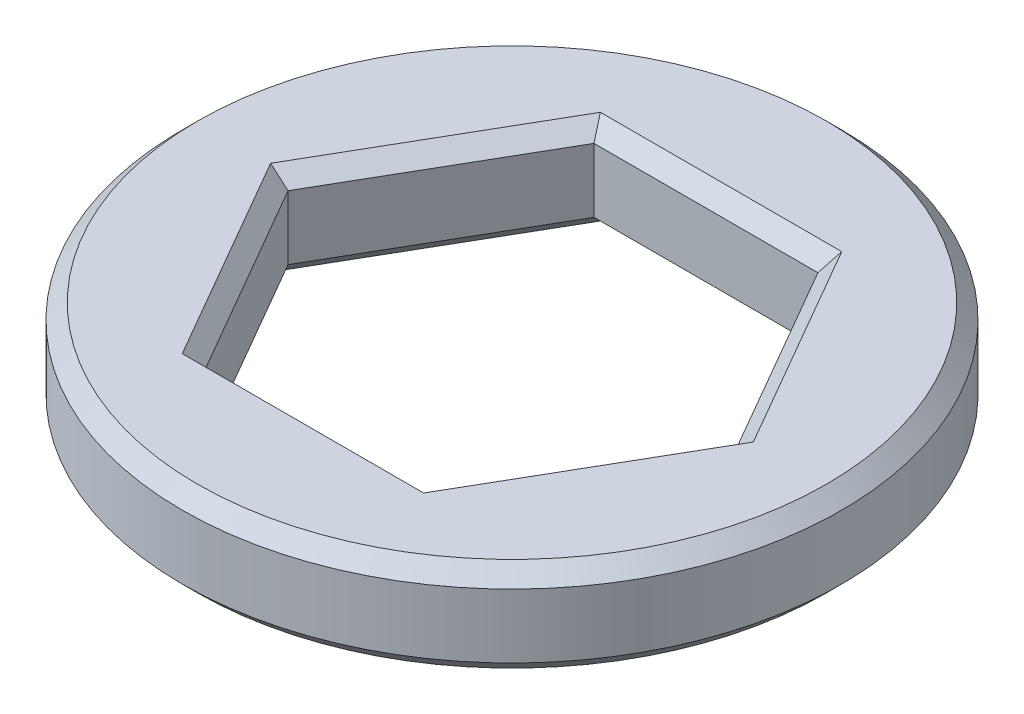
ISO-10303-21;
HEADER;
FILE_DESCRIPTION(('STEP AP214'),'2;1');
FILE_NAME('part.step','',(''),(''),'','','');
FILE_SCHEMA(('AUTOMOTIVE_DESIGN { 1 0 10303 214 1 1 1 1 }'));
ENDSEC;
DATA;
#1=APPLICATION_CONTEXT('core data for automotive mechanical design processes');
#2=APPLICATION_PROTOCOL_DEFINITION('international standard','automotive_design',2000,#1);
#3=PRODUCT_CONTEXT('',#1,'mechanical');
#4=PRODUCT('Part','Part','',(#3));
#5=PRODUCT_RELATED_PRODUCT_CATEGORY('part','',(#4));
#6=PRODUCT_DEFINITION_FORMATION('','',#4);
#7=PRODUCT_DEFINITION_CONTEXT('part definition',#1,'design');
#8=PRODUCT_DEFINITION('design','',#6,#7);
#9=PRODUCT_DEFINITION_SHAPE('','',#8);
#10=(LENGTH_UNIT() NAMED_UNIT(*) SI_UNIT(.MILLI.,.METRE.));
#11=(NAMED_UNIT(*) PLANE_ANGLE_UNIT() SI_UNIT($,.RADIAN.));
#12=(NAMED_UNIT(*) SI_UNIT($,.STERADIAN.) SOLID_ANGLE_UNIT());
#13=UNCERTAINTY_MEASURE_WITH_UNIT(LENGTH_MEASURE(1.E-05),#10,'distance_accuracy_value','');
#14=(GEOMETRIC_REPRESENTATION_CONTEXT(3) GLOBAL_UNCERTAINTY_ASSIGNED_CONTEXT((#13)) GLOBAL_UNIT_ASSIGNED_CONTEXT((#10,
#11,#12)) REPRESENTATION_CONTEXT('',''));
#15=CARTESIAN_POINT('',(0.,0.,0.));
#16=DIRECTION('',(0.,0.,1.));
#17=DIRECTION('',(1.,0.,0.));
#18=AXIS2_PLACEMENT_3D('',#15,#16,#17);
#19=CARTESIAN_POINT('',(0.,3.175,0.));
#20=DIRECTION('',(0.,1.,0.));
#21=DIRECTION('',(0.,0.,1.));
#22=AXIS2_PLACEMENT_3D('',#19,#20,#21);
#23=PLANE('',#22);
#24=CARTESIAN_POINT('',(0.,3.175,0.));
#25=DIRECTION('',(0.,1.,0.));
#26=DIRECTION('',(0.,0.,1.));
#27=AXIS2_PLACEMENT_3D('',#24,#25,#26);
#28=CIRCLE('',#27,10.6045);
#29=CARTESIAN_POINT('',(0.,3.175,10.6045));
#30=VERTEX_POINT('',#29);
#31=EDGE_CURVE('E13',#30,#30,#28,.T.);
#32=ORIENTED_EDGE('',*,*,#31,.T.);
#33=EDGE_LOOP('',(#32));
#34=FACE_BOUND('',#33,.T.);
#35=DIRECTION('',(-1.,0.,0.));
#36=VECTOR('',#35,1.);
#37=CARTESIAN_POINT('',(0.,3.175,7.0485));
#38=LINE('',#37,#36);
#39=CARTESIAN_POINT('',(4.06945337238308,3.175,7.0485));
#40=VERTEX_POINT('',#39);
#41=CARTESIAN_POINT('',(-4.06945337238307,3.175,7.04850000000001));
#42=VERTEX_POINT('',#41);
#43=EDGE_CURVE('E70',#40,#42,#38,.T.);
#44=ORIENTED_EDGE('',*,*,#43,.T.);
#45=DIRECTION('',(-0.5,0.,-0.866025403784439));
#46=VECTOR('',#45,1.);
#47=CARTESIAN_POINT('',(-6.10418005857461,3.175,3.52425));
#48=LINE('',#47,#46);
#49=CARTESIAN_POINT('',(-8.13890674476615,3.175,0.));
#50=VERTEX_POINT('',#49);
#51=EDGE_CURVE('E62',#42,#50,#48,.T.);
#52=ORIENTED_EDGE('',*,*,#51,.T.);
#53=DIRECTION('',(0.499999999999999,0.,-0.866025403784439));
#54=VECTOR('',#53,1.);
#55=CARTESIAN_POINT('',(-6.10418005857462,3.175,-3.52425));
#56=LINE('',#55,#54);
#57=CARTESIAN_POINT('',(-4.06945337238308,3.175,-7.0485));
#58=VERTEX_POINT('',#57);
#59=EDGE_CURVE('E225',#50,#58,#56,.T.);
#60=ORIENTED_EDGE('',*,*,#59,.T.);
#61=DIRECTION('',(1.,0.,0.));
#62=VECTOR('',#61,1.);
#63=CARTESIAN_POINT('',(0.,3.175,-7.0485));
#64=LINE('',#63,#62);
#65=CARTESIAN_POINT('',(4.06945337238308,3.175,-7.0485));
#66=VERTEX_POINT('',#65);
#67=EDGE_CURVE('E228',#58,#66,#64,.T.);
#68=ORIENTED_EDGE('',*,*,#67,.T.);
#69=DIRECTION('',(0.5,0.,0.866025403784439));
#70=VECTOR('',#69,1.);
#71=CARTESIAN_POINT('',(6.10418005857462,3.175,-3.52425));
#72=LINE('',#71,#70);
#73=CARTESIAN_POINT('',(8.13890674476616,3.175,0.));
#74=VERTEX_POINT('',#73);
#75=EDGE_CURVE('E231',#66,#74,#72,.T.);
#76=ORIENTED_EDGE('',*,*,#75,.T.);
#77=DIRECTION('',(-0.499999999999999,0.,0.866025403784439));
#78=VECTOR('',#77,1.);
#79=CARTESIAN_POINT('',(6.10418005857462,3.175,3.52425));
#80=LINE('',#79,#78);
#81=EDGE_CURVE('E75',#74,#40,#80,.T.);
#82=ORIENTED_EDGE('',*,*,#81,.T.);
#83=EDGE_LOOP('',(#44,#52,#60,#68,#76,#82));
#84=FACE_BOUND('',#83,.T.);
#85=ADVANCED_FACE('F51',(#34,#84),#23,.T.);
#86=CARTESIAN_POINT('',(0.,0.,0.));
#87=DIRECTION('',(0.,1.,0.));
#88=DIRECTION('',(0.,0.,1.));
#89=AXIS2_PLACEMENT_3D('',#86,#87,#88);
#90=PLANE('',#89);
#91=DIRECTION('',(0.5,0.,0.866025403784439));
#92=VECTOR('',#91,1.);
#93=CARTESIAN_POINT('',(-4.21610034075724,0.,6.79450000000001));
#94=LINE('',#93,#92);
#95=CARTESIAN_POINT('',(-8.13890674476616,0.,0.));
#96=VERTEX_POINT('',#95);
#97=CARTESIAN_POINT('',(-4.06945337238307,0.,7.04850000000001));
#98=VERTEX_POINT('',#97);
#99=EDGE_CURVE('E171',#96,#98,#94,.T.);
#100=ORIENTED_EDGE('',*,*,#99,.T.);
#101=DIRECTION('',(1.,0.,0.));
#102=VECTOR('',#101,1.);
#103=CARTESIAN_POINT('',(3.77615943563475,0.,7.0485));
#104=LINE('',#103,#102);
#105=CARTESIAN_POINT('',(4.06945337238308,0.,7.0485));
#106=VERTEX_POINT('',#105);
#107=EDGE_CURVE('E149',#98,#106,#104,.T.);
#108=ORIENTED_EDGE('',*,*,#107,.T.);
#109=DIRECTION('',(0.499999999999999,0.,-0.866025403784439));
#110=VECTOR('',#109,1.);
#111=CARTESIAN_POINT('',(7.99225977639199,0.,0.253999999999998));
#112=LINE('',#111,#110);
#113=CARTESIAN_POINT('',(8.13890674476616,0.,0.));
#114=VERTEX_POINT('',#113);
#115=EDGE_CURVE('E158',#106,#114,#112,.T.);
#116=ORIENTED_EDGE('',*,*,#115,.T.);
#117=DIRECTION('',(-0.5,0.,-0.866025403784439));
#118=VECTOR('',#117,1.);
#119=CARTESIAN_POINT('',(4.21610034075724,0.,-6.7945));
#120=LINE('',#119,#118);
#121=CARTESIAN_POINT('',(4.06945337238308,0.,-7.0485));
#122=VERTEX_POINT('',#121);
#123=EDGE_CURVE('E165',#114,#122,#120,.T.);
#124=ORIENTED_EDGE('',*,*,#123,.T.);
#125=DIRECTION('',(-1.,0.,0.));
#126=VECTOR('',#125,1.);
#127=CARTESIAN_POINT('',(-3.77615943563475,0.,-7.0485));
#128=LINE('',#127,#126);
#129=CARTESIAN_POINT('',(-4.06945337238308,0.,-7.0485));
#130=VERTEX_POINT('',#129);
#131=EDGE_CURVE('E332',#122,#130,#128,.T.);
#132=ORIENTED_EDGE('',*,*,#131,.T.);
#133=DIRECTION('',(-0.499999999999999,0.,0.866025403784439));
#134=VECTOR('',#133,1.);
#135=CARTESIAN_POINT('',(-7.99225977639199,0.,-0.253999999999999));
#136=LINE('',#135,#134);
#137=EDGE_CURVE('E180',#130,#96,#136,.T.);
#138=ORIENTED_EDGE('',*,*,#137,.T.);
#139=EDGE_LOOP('',(#100,#108,#116,#124,#132,#138));
#140=FACE_BOUND('',#139,.T.);
#141=CARTESIAN_POINT('',(0.,0.,0.));
#142=DIRECTION('',(0.,1.,0.));
#143=DIRECTION('',(0.,0.,1.));
#144=AXIS2_PLACEMENT_3D('',#141,#142,#143);
#145=CIRCLE('',#144,10.6045);
#146=CARTESIAN_POINT('',(0.,0.,10.6045));
#147=VERTEX_POINT('',#146);
#148=EDGE_CURVE('E166',#147,#147,#145,.F.);
#149=ORIENTED_EDGE('',*,*,#148,.T.);
#150=EDGE_LOOP('',(#149));
#151=FACE_BOUND('',#150,.T.);
#152=ADVANCED_FACE('F168',(#140,#151),#90,.F.);
#153=CARTESIAN_POINT('',(0.,3.175,0.));
#154=DIRECTION('',(0.,-1.,0.));
#155=DIRECTION('',(0.,0.,-1.));
#156=AXIS2_PLACEMENT_3D('',#153,#154,#155);
#157=CYLINDRICAL_SURFACE('',#156,11.1125);
#158=CARTESIAN_POINT('',(0.,0.507999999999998,0.));
#159=DIRECTION('',(0.,1.,0.));
#160=DIRECTION('',(0.,0.,1.));
#161=AXIS2_PLACEMENT_3D('',#158,#159,#160);
#162=CIRCLE('',#161,11.1125);
#163=CARTESIAN_POINT('',(0.,0.507999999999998,11.1125));
#164=VERTEX_POINT('',#163);
#165=EDGE_CURVE('E221',#164,#164,#162,.T.);
#166=ORIENTED_EDGE('',*,*,#165,.T.);
#167=EDGE_LOOP('',(#166));
#168=FACE_BOUND('',#167,.T.);
#169=CARTESIAN_POINT('',(0.,2.667,0.));
#170=DIRECTION('',(0.,1.,0.));
#171=DIRECTION('',(0.,0.,1.));
#172=AXIS2_PLACEMENT_3D('',#169,#170,#171);
#173=CIRCLE('',#172,11.1125);
#174=CARTESIAN_POINT('',(0.,2.667,11.1125));
#175=VERTEX_POINT('',#174);
#176=EDGE_CURVE('E217',#175,#175,#173,.F.);
#177=ORIENTED_EDGE('',*,*,#176,.T.);
#178=EDGE_LOOP('',(#177));
#179=FACE_BOUND('',#178,.T.);
#180=ADVANCED_FACE('F381',(#168,#179),#157,.T.);
#181=CARTESIAN_POINT('',(3.77615943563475,3.175,6.5405));
#182=DIRECTION('',(-0.866025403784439,0.,-0.499999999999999));
#183=DIRECTION('',(-0.499999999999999,0.,0.866025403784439));
#184=AXIS2_PLACEMENT_3D('',#181,#182,#183);
#185=PLANE('',#184);
#186=DIRECTION('',(0.,-1.,0.));
#187=VECTOR('',#186,1.);
#188=CARTESIAN_POINT('',(7.55231887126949,3.175,0.));
#189=LINE('',#188,#187);
#190=CARTESIAN_POINT('',(7.55231887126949,2.667,0.));
#191=VERTEX_POINT('',#190);
#192=CARTESIAN_POINT('',(7.55231887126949,0.508000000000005,0.));
#193=VERTEX_POINT('',#192);
#194=EDGE_CURVE('E323',#191,#193,#189,.T.);
#195=ORIENTED_EDGE('',*,*,#194,.T.);
#196=DIRECTION('',(-0.499999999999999,0.,0.866025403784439));
#197=VECTOR('',#196,1.);
#198=CARTESIAN_POINT('',(3.77615943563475,0.508000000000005,6.5405));
#199=LINE('',#198,#197);
#200=CARTESIAN_POINT('',(3.77615943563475,0.508000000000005,6.5405));
#201=VERTEX_POINT('',#200);
#202=EDGE_CURVE('E214',#193,#201,#199,.T.);
#203=ORIENTED_EDGE('',*,*,#202,.T.);
#204=DIRECTION('',(0.,-1.,0.));
#205=VECTOR('',#204,1.);
#206=CARTESIAN_POINT('',(3.77615943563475,3.175,6.5405));
#207=LINE('',#206,#205);
#208=CARTESIAN_POINT('',(3.77615943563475,2.667,6.5405));
#209=VERTEX_POINT('',#208);
#210=EDGE_CURVE('E256',#209,#201,#207,.T.);
#211=ORIENTED_EDGE('',*,*,#210,.F.);
#212=DIRECTION('',(0.499999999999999,0.,-0.866025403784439));
#213=VECTOR('',#212,1.);
#214=CARTESIAN_POINT('',(3.77615943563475,2.667,6.5405));
#215=LINE('',#214,#213);
#216=EDGE_CURVE('E211',#209,#191,#215,.T.);
#217=ORIENTED_EDGE('',*,*,#216,.T.);
#218=EDGE_LOOP('',(#195,#203,#211,#217));
#219=FACE_BOUND('',#218,.T.);
#220=ADVANCED_FACE('F359',(#219),#185,.T.);
#221=CARTESIAN_POINT('',(7.55231887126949,3.175,0.));
#222=DIRECTION('',(-0.866025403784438,0.,0.5));
#223=DIRECTION('',(0.5,0.,0.866025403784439));
#224=AXIS2_PLACEMENT_3D('',#221,#222,#223);
#225=PLANE('',#224);
#226=DIRECTION('',(0.,-1.,0.));
#227=VECTOR('',#226,1.);
#228=CARTESIAN_POINT('',(3.77615943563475,3.175,-6.5405));
#229=LINE('',#228,#227);
#230=CARTESIAN_POINT('',(3.77615943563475,2.667,-6.5405));
#231=VERTEX_POINT('',#230);
#232=CARTESIAN_POINT('',(3.77615943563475,0.508000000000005,-6.5405));
#233=VERTEX_POINT('',#232);
#234=EDGE_CURVE('E315',#231,#233,#229,.T.);
#235=ORIENTED_EDGE('',*,*,#234,.T.);
#236=DIRECTION('',(0.5,0.,0.866025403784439));
#237=VECTOR('',#236,1.);
#238=CARTESIAN_POINT('',(7.55231887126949,0.508000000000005,0.));
#239=LINE('',#238,#237);
#240=EDGE_CURVE('E208',#233,#193,#239,.T.);
#241=ORIENTED_EDGE('',*,*,#240,.T.);
#242=ORIENTED_EDGE('',*,*,#194,.F.);
#243=DIRECTION('',(-0.5,0.,-0.866025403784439));
#244=VECTOR('',#243,1.);
#245=CARTESIAN_POINT('',(7.55231887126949,2.667,0.));
#246=LINE('',#245,#244);
#247=EDGE_CURVE('E205',#191,#231,#246,.T.);
#248=ORIENTED_EDGE('',*,*,#247,.T.);
#249=EDGE_LOOP('',(#235,#241,#242,#248));
#250=FACE_BOUND('',#249,.T.);
#251=ADVANCED_FACE('F582',(#250),#225,.T.);
#252=CARTESIAN_POINT('',(3.77615943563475,3.175,-6.5405));
#253=DIRECTION('',(0.,0.,1.));
#254=DIRECTION('',(1.,0.,0.));
#255=AXIS2_PLACEMENT_3D('',#252,#253,#254);
#256=PLANE('',#255);
#257=DIRECTION('',(0.,-1.,0.));
#258=VECTOR('',#257,1.);
#259=CARTESIAN_POINT('',(-3.77615943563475,3.175,-6.5405));
#260=LINE('',#259,#258);
#261=CARTESIAN_POINT('',(-3.77615943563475,2.667,-6.5405));
#262=VERTEX_POINT('',#261);
#263=CARTESIAN_POINT('',(-3.77615943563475,0.508000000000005,-6.5405));
#264=VERTEX_POINT('',#263);
#265=EDGE_CURVE('E303',#262,#264,#260,.T.);
#266=ORIENTED_EDGE('',*,*,#265,.T.);
#267=DIRECTION('',(1.,0.,0.));
#268=VECTOR('',#267,1.);
#269=CARTESIAN_POINT('',(3.77615943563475,0.508000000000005,-6.5405));
#270=LINE('',#269,#268);
#271=EDGE_CURVE('E202',#264,#233,#270,.T.);
#272=ORIENTED_EDGE('',*,*,#271,.T.);
#273=ORIENTED_EDGE('',*,*,#234,.F.);
#274=DIRECTION('',(-1.,0.,0.));
#275=VECTOR('',#274,1.);
#276=CARTESIAN_POINT('',(3.77615943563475,2.667,-6.5405));
#277=LINE('',#276,#275);
#278=EDGE_CURVE('E199',#231,#262,#277,.T.);
#279=ORIENTED_EDGE('',*,*,#278,.T.);
#280=EDGE_LOOP('',(#266,#272,#273,#279));
#281=FACE_BOUND('',#280,.T.);
#282=ADVANCED_FACE('F573',(#281),#256,.T.);
#283=CARTESIAN_POINT('',(-3.77615943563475,3.175,-6.5405));
#284=DIRECTION('',(0.866025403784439,0.,0.499999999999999));
#285=DIRECTION('',(0.499999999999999,0.,-0.866025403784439));
#286=AXIS2_PLACEMENT_3D('',#283,#284,#285);
#287=PLANE('',#286);
#288=DIRECTION('',(0.,-1.,0.));
#289=VECTOR('',#288,1.);
#290=CARTESIAN_POINT('',(-7.55231887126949,3.175,0.));
#291=LINE('',#290,#289);
#292=CARTESIAN_POINT('',(-7.55231887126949,2.667,0.));
#293=VERTEX_POINT('',#292);
#294=CARTESIAN_POINT('',(-7.55231887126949,0.508000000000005,0.));
#295=VERTEX_POINT('',#294);
#296=EDGE_CURVE('E300',#293,#295,#291,.T.);
#297=ORIENTED_EDGE('',*,*,#296,.T.);
#298=DIRECTION('',(0.499999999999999,0.,-0.866025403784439));
#299=VECTOR('',#298,1.);
#300=CARTESIAN_POINT('',(-3.77615943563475,0.508000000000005,-6.5405));
#301=LINE('',#300,#299);
#302=EDGE_CURVE('E196',#295,#264,#301,.T.);
#303=ORIENTED_EDGE('',*,*,#302,.T.);
#304=ORIENTED_EDGE('',*,*,#265,.F.);
#305=DIRECTION('',(-0.499999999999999,0.,0.866025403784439));
#306=VECTOR('',#305,1.);
#307=CARTESIAN_POINT('',(-3.77615943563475,2.667,-6.5405));
#308=LINE('',#307,#306);
#309=EDGE_CURVE('E193',#262,#293,#308,.T.);
#310=ORIENTED_EDGE('',*,*,#309,.T.);
#311=EDGE_LOOP('',(#297,#303,#304,#310));
#312=FACE_BOUND('',#311,.T.);
#313=ADVANCED_FACE('F299',(#312),#287,.T.);
#314=CARTESIAN_POINT('',(-7.55231887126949,3.175,0.));
#315=DIRECTION('',(0.866025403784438,0.,-0.5));
#316=DIRECTION('',(-0.5,0.,-0.866025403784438));
#317=AXIS2_PLACEMENT_3D('',#314,#315,#316);
#318=PLANE('',#317);
#319=DIRECTION('',(0.,-1.,0.));
#320=VECTOR('',#319,1.);
#321=CARTESIAN_POINT('',(-3.77615943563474,3.175,6.5405));
#322=LINE('',#321,#320);
#323=CARTESIAN_POINT('',(-3.77615943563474,2.667,6.5405));
#324=VERTEX_POINT('',#323);
#325=CARTESIAN_POINT('',(-3.77615943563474,0.508000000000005,6.5405));
#326=VERTEX_POINT('',#325);
#327=EDGE_CURVE('E310',#324,#326,#322,.T.);
#328=ORIENTED_EDGE('',*,*,#327,.T.);
#329=DIRECTION('',(-0.5,0.,-0.866025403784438));
#330=VECTOR('',#329,1.);
#331=CARTESIAN_POINT('',(-7.55231887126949,0.508000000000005,0.));
#332=LINE('',#331,#330);
#333=EDGE_CURVE('E190',#326,#295,#332,.T.);
#334=ORIENTED_EDGE('',*,*,#333,.T.);
#335=ORIENTED_EDGE('',*,*,#296,.F.);
#336=DIRECTION('',(0.5,0.,0.866025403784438));
#337=VECTOR('',#336,1.);
#338=CARTESIAN_POINT('',(-7.55231887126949,2.667,0.));
#339=LINE('',#338,#337);
#340=EDGE_CURVE('E186',#293,#324,#339,.T.);
#341=ORIENTED_EDGE('',*,*,#340,.T.);
#342=EDGE_LOOP('',(#328,#334,#335,#341));
#343=FACE_BOUND('',#342,.T.);
#344=ADVANCED_FACE('F306',(#343),#318,.T.);
#345=CARTESIAN_POINT('',(-3.77615943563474,3.175,6.5405));
#346=DIRECTION('',(0.,0.,-1.));
#347=DIRECTION('',(-1.,0.,0.));
#348=AXIS2_PLACEMENT_3D('',#345,#346,#347);
#349=PLANE('',#348);
#350=ORIENTED_EDGE('',*,*,#210,.T.);
#351=DIRECTION('',(-1.,0.,0.));
#352=VECTOR('',#351,1.);
#353=CARTESIAN_POINT('',(-3.77615943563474,0.508000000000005,6.5405));
#354=LINE('',#353,#352);
#355=EDGE_CURVE('E151',#201,#326,#354,.T.);
#356=ORIENTED_EDGE('',*,*,#355,.T.);
#357=ORIENTED_EDGE('',*,*,#327,.F.);
#358=DIRECTION('',(1.,0.,0.));
#359=VECTOR('',#358,1.);
#360=CARTESIAN_POINT('',(-3.77615943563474,2.667,6.5405));
#361=LINE('',#360,#359);
#362=EDGE_CURVE('E174',#324,#209,#361,.T.);
#363=ORIENTED_EDGE('',*,*,#362,.T.);
#364=EDGE_LOOP('',(#350,#356,#357,#363));
#365=FACE_BOUND('',#364,.T.);
#366=ADVANCED_FACE('F346',(#365),#349,.T.);
#367=CARTESIAN_POINT('',(0.,0.,-7.0485));
#368=DIRECTION('',(0.,-0.707106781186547,0.707106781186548));
#369=DIRECTION('',(1.,0.,0.));
#370=AXIS2_PLACEMENT_3D('',#367,#368,#369);
#371=PLANE('',#370);
#372=DIRECTION('',(0.377964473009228,-0.654653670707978,-0.654653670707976));
#373=VECTOR('',#372,1.);
#374=CARTESIAN_POINT('',(3.48810289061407,1.00692857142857,-6.04157142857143));
#375=LINE('',#374,#373);
#376=EDGE_CURVE('E248',#233,#122,#375,.T.);
#377=ORIENTED_EDGE('',*,*,#376,.F.);
#378=ORIENTED_EDGE('',*,*,#271,.F.);
#379=DIRECTION('',(-0.377964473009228,-0.654653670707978,-0.654653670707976));
#380=VECTOR('',#379,1.);
#381=CARTESIAN_POINT('',(-3.48810289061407,1.00692857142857,-6.04157142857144));
#382=LINE('',#381,#380);
#383=EDGE_CURVE('E252',#130,#264,#382,.F.);
#384=ORIENTED_EDGE('',*,*,#383,.F.);
#385=ORIENTED_EDGE('',*,*,#131,.F.);
#386=EDGE_LOOP('',(#377,#378,#384,#385));
#387=FACE_BOUND('',#386,.T.);
#388=ADVANCED_FACE('F419',(#387),#371,.T.);
#389=CARTESIAN_POINT('',(-6.10418005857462,0.,-3.52425));
#390=DIRECTION('',(0.612372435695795,-0.707106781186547,0.353553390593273));
#391=DIRECTION('',(0.499999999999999,0.,-0.866025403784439));
#392=AXIS2_PLACEMENT_3D('',#389,#390,#391);
#393=PLANE('',#392);
#394=ORIENTED_EDGE('',*,*,#383,.T.);
#395=ORIENTED_EDGE('',*,*,#302,.F.);
#396=DIRECTION('',(-0.755928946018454,-0.654653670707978,0.));
#397=VECTOR('',#396,1.);
#398=CARTESIAN_POINT('',(-6.97620578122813,1.00692857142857,0.));
#399=LINE('',#398,#397);
#400=EDGE_CURVE('E244',#96,#295,#399,.F.);
#401=ORIENTED_EDGE('',*,*,#400,.F.);
#402=ORIENTED_EDGE('',*,*,#137,.F.);
#403=EDGE_LOOP('',(#394,#395,#401,#402));
#404=FACE_BOUND('',#403,.T.);
#405=ADVANCED_FACE('F341',(#404),#393,.T.);
#406=CARTESIAN_POINT('',(6.10418005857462,0.,-3.52425));
#407=DIRECTION('',(-0.612372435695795,-0.707106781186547,0.353553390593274));
#408=DIRECTION('',(0.5,0.,0.866025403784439));
#409=AXIS2_PLACEMENT_3D('',#406,#407,#408);
#410=PLANE('',#409);
#411=ORIENTED_EDGE('',*,*,#376,.T.);
#412=ORIENTED_EDGE('',*,*,#123,.F.);
#413=DIRECTION('',(0.755928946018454,-0.654653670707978,0.));
#414=VECTOR('',#413,1.);
#415=CARTESIAN_POINT('',(6.97620578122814,1.00692857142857,0.));
#416=LINE('',#415,#414);
#417=EDGE_CURVE('E161',#193,#114,#416,.T.);
#418=ORIENTED_EDGE('',*,*,#417,.F.);
#419=ORIENTED_EDGE('',*,*,#240,.F.);
#420=EDGE_LOOP('',(#411,#412,#418,#419));
#421=FACE_BOUND('',#420,.T.);
#422=ADVANCED_FACE('F407',(#421),#410,.T.);
#423=CARTESIAN_POINT('',(-6.10418005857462,0.,3.52425));
#424=DIRECTION('',(0.612372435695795,-0.707106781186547,-0.353553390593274));
#425=DIRECTION('',(-0.5,0.,-0.866025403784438));
#426=AXIS2_PLACEMENT_3D('',#423,#424,#425);
#427=PLANE('',#426);
#428=ORIENTED_EDGE('',*,*,#400,.T.);
#429=ORIENTED_EDGE('',*,*,#333,.F.);
#430=DIRECTION('',(-0.377964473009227,-0.654653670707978,0.654653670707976));
#431=VECTOR('',#430,1.);
#432=CARTESIAN_POINT('',(-3.48810289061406,1.00692857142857,6.04157142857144));
#433=LINE('',#432,#431);
#434=EDGE_CURVE('E155',#98,#326,#433,.F.);
#435=ORIENTED_EDGE('',*,*,#434,.F.);
#436=ORIENTED_EDGE('',*,*,#99,.F.);
#437=EDGE_LOOP('',(#428,#429,#435,#436));
#438=FACE_BOUND('',#437,.T.);
#439=ADVANCED_FACE('F343',(#438),#427,.T.);
#440=CARTESIAN_POINT('',(6.10418005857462,0.,3.52425));
#441=DIRECTION('',(-0.612372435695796,-0.707106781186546,-0.353553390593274));
#442=DIRECTION('',(-0.499999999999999,0.,0.866025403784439));
#443=AXIS2_PLACEMENT_3D('',#440,#441,#442);
#444=PLANE('',#443);
#445=ORIENTED_EDGE('',*,*,#417,.T.);
#446=ORIENTED_EDGE('',*,*,#115,.F.);
#447=DIRECTION('',(-0.377964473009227,0.654653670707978,-0.654653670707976));
#448=VECTOR('',#447,1.);
#449=CARTESIAN_POINT('',(3.48810289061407,1.00692857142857,6.04157142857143));
#450=LINE('',#449,#448);
#451=EDGE_CURVE('E145',#201,#106,#450,.F.);
#452=ORIENTED_EDGE('',*,*,#451,.F.);
#453=ORIENTED_EDGE('',*,*,#202,.F.);
#454=EDGE_LOOP('',(#445,#446,#452,#453));
#455=FACE_BOUND('',#454,.T.);
#456=ADVANCED_FACE('F159',(#455),#444,.T.);
#457=CARTESIAN_POINT('',(0.,0.,7.04850000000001));
#458=DIRECTION('',(0.,-0.707106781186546,-0.707106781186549));
#459=DIRECTION('',(-1.,0.,0.));
#460=AXIS2_PLACEMENT_3D('',#457,#458,#459);
#461=PLANE('',#460);
#462=ORIENTED_EDGE('',*,*,#434,.T.);
#463=ORIENTED_EDGE('',*,*,#355,.F.);
#464=ORIENTED_EDGE('',*,*,#451,.T.);
#465=ORIENTED_EDGE('',*,*,#107,.F.);
#466=EDGE_LOOP('',(#462,#463,#464,#465));
#467=FACE_BOUND('',#466,.T.);
#468=ADVANCED_FACE('F147',(#467),#461,.T.);
#469=CARTESIAN_POINT('',(0.,0.507999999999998,0.));
#470=DIRECTION('',(0.,1.,0.));
#471=DIRECTION('',(0.,0.,1.));
#472=AXIS2_PLACEMENT_3D('',#469,#470,#471);
#473=CONICAL_SURFACE('',#472,11.1125,0.78539816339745);
#474=ORIENTED_EDGE('',*,*,#148,.F.);
#475=EDGE_LOOP('',(#474));
#476=FACE_BOUND('',#475,.T.);
#477=ORIENTED_EDGE('',*,*,#165,.F.);
#478=EDGE_LOOP('',(#477));
#479=FACE_BOUND('',#478,.T.);
#480=ADVANCED_FACE('F396',(#476,#479),#473,.T.);
#481=CARTESIAN_POINT('',(0.,3.175,0.));
#482=DIRECTION('',(0.,-1.,0.));
#483=DIRECTION('',(0.,0.,-1.));
#484=AXIS2_PLACEMENT_3D('',#481,#482,#483);
#485=CONICAL_SURFACE('',#484,10.6045,0.785398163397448);
#486=ORIENTED_EDGE('',*,*,#176,.F.);
#487=EDGE_LOOP('',(#486));
#488=FACE_BOUND('',#487,.T.);
#489=ORIENTED_EDGE('',*,*,#31,.F.);
#490=EDGE_LOOP('',(#489));
#491=FACE_BOUND('',#490,.T.);
#492=ADVANCED_FACE('F429',(#488,#491),#485,.T.);
#493=CARTESIAN_POINT('',(7.55231887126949,2.667,0.));
#494=DIRECTION('',(0.612372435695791,-0.707106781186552,-0.353553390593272));
#495=DIRECTION('',(-0.5,0.,-0.866025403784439));
#496=AXIS2_PLACEMENT_3D('',#493,#494,#495);
#497=PLANE('',#496);
#498=DIRECTION('',(0.755928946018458,0.654653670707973,0.));
#499=VECTOR('',#498,1.);
#500=CARTESIAN_POINT('',(5.39451347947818,0.798285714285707,0.));
#501=LINE('',#500,#499);
#502=EDGE_CURVE('E270',#74,#191,#501,.F.);
#503=ORIENTED_EDGE('',*,*,#502,.F.);
#504=ORIENTED_EDGE('',*,*,#75,.F.);
#505=DIRECTION('',(0.377964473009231,0.654653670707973,-0.654653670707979));
#506=VECTOR('',#505,1.);
#507=CARTESIAN_POINT('',(2.6972567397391,0.798285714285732,-4.67178571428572));
#508=LINE('',#507,#506);
#509=EDGE_CURVE('E56',#231,#66,#508,.T.);
#510=ORIENTED_EDGE('',*,*,#509,.F.);
#511=ORIENTED_EDGE('',*,*,#247,.F.);
#512=EDGE_LOOP('',(#503,#504,#510,#511));
#513=FACE_BOUND('',#512,.T.);
#514=ADVANCED_FACE('F54',(#513),#497,.F.);
#515=CARTESIAN_POINT('',(3.77615943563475,2.667,-6.5405));
#516=DIRECTION('',(0.,-0.70710678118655,-0.707106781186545));
#517=DIRECTION('',(-1.,0.,0.));
#518=AXIS2_PLACEMENT_3D('',#515,#516,#517);
#519=PLANE('',#518);
#520=ORIENTED_EDGE('',*,*,#509,.T.);
#521=ORIENTED_EDGE('',*,*,#67,.F.);
#522=DIRECTION('',(-0.377964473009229,0.654653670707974,-0.654653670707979));
#523=VECTOR('',#522,1.);
#524=CARTESIAN_POINT('',(-2.6972567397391,0.798285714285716,-4.6717857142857));
#525=LINE('',#524,#523);
#526=EDGE_CURVE('E267',#262,#58,#525,.T.);
#527=ORIENTED_EDGE('',*,*,#526,.F.);
#528=ORIENTED_EDGE('',*,*,#278,.F.);
#529=EDGE_LOOP('',(#520,#521,#527,#528));
#530=FACE_BOUND('',#529,.T.);
#531=ADVANCED_FACE('F284',(#530),#519,.F.);
#532=CARTESIAN_POINT('',(3.77615943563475,2.667,6.5405));
#533=DIRECTION('',(0.612372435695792,-0.70710678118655,0.353553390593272));
#534=DIRECTION('',(0.499999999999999,0.,-0.866025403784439));
#535=AXIS2_PLACEMENT_3D('',#532,#533,#534);
#536=PLANE('',#535);
#537=ORIENTED_EDGE('',*,*,#502,.T.);
#538=ORIENTED_EDGE('',*,*,#216,.F.);
#539=DIRECTION('',(0.377964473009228,0.654653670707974,0.65465367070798));
#540=VECTOR('',#539,1.);
#541=CARTESIAN_POINT('',(2.6972567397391,0.798285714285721,4.67178571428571));
#542=LINE('',#541,#540);
#543=EDGE_CURVE('E263',#40,#209,#542,.F.);
#544=ORIENTED_EDGE('',*,*,#543,.F.);
#545=ORIENTED_EDGE('',*,*,#81,.F.);
#546=EDGE_LOOP('',(#537,#538,#544,#545));
#547=FACE_BOUND('',#546,.T.);
#548=ADVANCED_FACE('F361',(#547),#536,.F.);
#549=CARTESIAN_POINT('',(-3.77615943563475,2.667,-6.5405));
#550=DIRECTION('',(-0.612372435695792,-0.70710678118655,-0.353553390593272));
#551=DIRECTION('',(-0.499999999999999,0.,0.866025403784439));
#552=AXIS2_PLACEMENT_3D('',#549,#550,#551);
#553=PLANE('',#552);
#554=ORIENTED_EDGE('',*,*,#526,.T.);
#555=ORIENTED_EDGE('',*,*,#59,.F.);
#556=DIRECTION('',(0.755928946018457,-0.654653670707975,0.));
#557=VECTOR('',#556,1.);
#558=CARTESIAN_POINT('',(-7.55231887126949,2.667,0.));
#559=LINE('',#558,#557);
#560=EDGE_CURVE('E260',#293,#50,#559,.F.);
#561=ORIENTED_EDGE('',*,*,#560,.F.);
#562=ORIENTED_EDGE('',*,*,#309,.F.);
#563=EDGE_LOOP('',(#554,#555,#561,#562));
#564=FACE_BOUND('',#563,.T.);
#565=ADVANCED_FACE('F292',(#564),#553,.F.);
#566=CARTESIAN_POINT('',(-3.77615943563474,2.667,6.5405));
#567=DIRECTION('',(0.,-0.707106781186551,0.707106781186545));
#568=DIRECTION('',(1.,0.,0.));
#569=AXIS2_PLACEMENT_3D('',#566,#567,#568);
#570=PLANE('',#569);
#571=ORIENTED_EDGE('',*,*,#543,.T.);
#572=ORIENTED_EDGE('',*,*,#362,.F.);
#573=DIRECTION('',(-0.377964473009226,0.654653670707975,0.65465367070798));
#574=VECTOR('',#573,1.);
#575=CARTESIAN_POINT('',(-2.69725673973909,0.798285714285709,4.6717857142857));
#576=LINE('',#575,#574);
#577=EDGE_CURVE('E257',#42,#324,#576,.F.);
#578=ORIENTED_EDGE('',*,*,#577,.F.);
#579=ORIENTED_EDGE('',*,*,#43,.F.);
#580=EDGE_LOOP('',(#571,#572,#578,#579));
#581=FACE_BOUND('',#580,.T.);
#582=ADVANCED_FACE('F363',(#581),#570,.F.);
#583=CARTESIAN_POINT('',(-7.55231887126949,2.667,0.));
#584=DIRECTION('',(-0.612372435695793,-0.707106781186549,0.353553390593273));
#585=DIRECTION('',(0.5,0.,0.866025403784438));
#586=AXIS2_PLACEMENT_3D('',#583,#584,#585);
#587=PLANE('',#586);
#588=ORIENTED_EDGE('',*,*,#560,.T.);
#589=ORIENTED_EDGE('',*,*,#51,.F.);
#590=ORIENTED_EDGE('',*,*,#577,.T.);
#591=ORIENTED_EDGE('',*,*,#340,.F.);
#592=EDGE_LOOP('',(#588,#589,#590,#591));
#593=FACE_BOUND('',#592,.T.);
#594=ADVANCED_FACE('F366',(#593),#587,.F.);
#595=CLOSED_SHELL('',(#85,#152,#180,#220,#251,#282,#313,#344,#366,#388,#405,#422,#439,#456,#468,
#480,#492,#514,#531,#548,#565,#582,#594));
#596=MANIFOLD_SOLID_BREP('B2',#595);
#597=ADVANCED_BREP_SHAPE_REPRESENTATION('',(#18,#596),#14);
#598=SHAPE_DEFINITION_REPRESENTATION(#9,#597);
ENDSEC;
END-ISO-10303-21;
